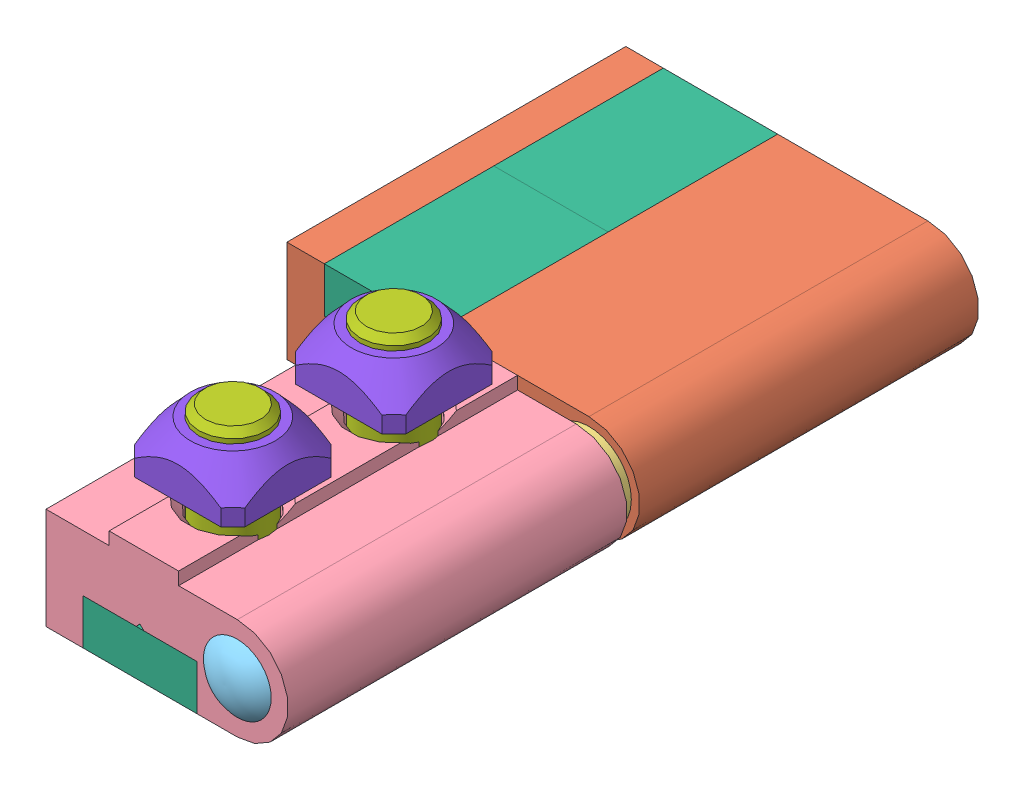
SolidWorks assembly 21.1095 HINGE 32 RIGHT HAND.SLDASM, configuration Default (file format 3800). Lengths in mm.
Overall size (41.65 34.61 84.51).
18 component instances, 8 part files, 39 mates.
Components (placement in the parent):
- 21.1096 HINGE PIN-1: 21.1096 HINGE PIN.SLDPRT [Default] at origin size (6.07 6.07 65)
- 21.1096 HINGE 45 AL BLOCK-2: 21.1096 HINGE 45 AL BLOCK.SLDPRT [Default] at (-24.5 -6 -8.25) x (-1 0 0) z (0 0 -1) size (41.65 13.5 40)
- 21.1096 HINGE WASHER-1: 21.1096 HINGE WASHER.SLDPRT [Default] at (0 0 31.75) size (10 10 1.5)
- 21.1100 HINGE 19 AL BLOCK-1: 21.1100 HINGE 19 AL BLOCK.SLDPRT [Default] at (-11.5 6 73.25) x (-1 0 0) z (0 0 1) size (28.58 13.5 40)
- 21.1096 HINGE PIN END CAP-1: 21.1096 HINGE PIN END CAP.SLDPRT [Default] at (0 0 74.75) x (1 0 0) z (0 -1 0) size (8 7 8)
- 21.1096 HINGE PIN END CAP-2: 21.1096 HINGE PIN END CAP.SLDPRT [Default] at (0 0 -9.75) x (1 0 0) z (0 1 0) size (8 7 8)
- 22.1050 HINGE SCREW CAP-1: 22.1050 HINGE SCREW CAP.SLDPRT [Default] at (-18.2316 -6 63.25) x (0 0 1) z (1 0 0) size (20 5.34 13.5)
- 22.1050 HINGE SCREW CAP-2: 22.1050 HINGE SCREW CAP.SLDPRT [Default] at (-18.2316 -6 43.25) x (0 0 1) z (1 0 0) size (20 5.34 13.5)
- 22.1050 HINGE SCREW CAP-3: 22.1050 HINGE SCREW CAP.SLDPRT [Default] at (-17.7316 6 21.75) x (0 0 1) z (-1 0 0) size (20 5.34 13.5)
- 22.1050 HINGE SCREW CAP-4: 22.1050 HINGE SCREW CAP.SLDPRT [Default] at (-17.7316 6 1.75) x (0 0 1) z (-1 0 0) size (20 5.34 13.5)
- 21.1268 M8X18-1: 21.1268 M8X18.SLDPRT [Default] at (-11.0292 -0.6971 43.75) x (0 1 0) z (0 0 1) size (23 13 13)
- 21.1268 M8X18-2: 21.1268 M8X18.SLDPRT [Default] at (-11.0292 -0.6971 62.75) x (0 1 0) z (0 0 1) size (23 13 13)
- 21.1268 M8X18-3: 21.1268 M8X18.SLDPRT [Default] at (-24.0292 0.6971 21.25) x (0 -1 0) z (0 0 1) size (23 13 13)
- 21.1268 M8X18-4: 21.1268 M8X18.SLDPRT [Default] at (-24.0292 0.6971 2.25) x (0 -1 0) z (0 0 1) size (23 13 13)
- 21.1351 M8 SQUARE NUT-1: 21.1351 M8 SQUARE NUT.SLDPRT [Default] at (-24.0292 -10.5 2.25) x (1 0 0) z (0 1 0) size (13 13 5.5)
- 21.1351 M8 SQUARE NUT-2: 21.1351 M8 SQUARE NUT.SLDPRT [Default] at (-11.0292 10.5 62.75) x (1 0 0) z (0 -1 0) size (13 13 5.5)
- 21.1351 M8 SQUARE NUT-3: 21.1351 M8 SQUARE NUT.SLDPRT [Default] at (-24.0292 -10.5 21.25) x (1 0 0) z (0 1 0) size (13 13 5.5)
- 21.1351 M8 SQUARE NUT-4: 21.1351 M8 SQUARE NUT.SLDPRT [Default] at (-11.0292 10.5 43.75) x (1 0 0) z (0 -1 0) size (13 13 5.5)
Mates (geometry in assembly coordinates):
- Coincident1: coincident aligned: axis of 21.1096 HINGE 45 AL BLOCK-2; axis of 21.1096 HINGE PIN-1
- Distance1: distance = 33.25 mm aligned: plane of 21.1096 HINGE PIN-1 through (0 0 65) normal (0 0 1); plane of 21.1096 HINGE 45 AL BLOCK-2 through (-17.0063 -0.593 31.75) normal (0 0 1)
- Coincident3: coincident aligned: axis of 21.1096 HINGE PIN-1; axis of 21.1096 HINGE WASHER-1
- Coincident4: coincident anti-aligned: plane of 21.1096 HINGE 45 AL BLOCK-2 through (-17.0063 -0.593 31.75) normal (0 0 1); plane of 21.1096 HINGE WASHER-1 through (0 0 31.75) normal (0 0 -1)
- Coincident5: coincident anti-aligned: axis of 21.1096 HINGE PIN-1; axis of 21.1100 HINGE 19 AL BLOCK-1
- Coincident6: coincident anti-aligned: plane of 21.1096 HINGE WASHER-1 through (0 0 33.25) normal (0 0 1); plane of 21.1100 HINGE 19 AL BLOCK-1 through (-9.7205 0.7653 33.25) normal (0 0 -1)
- Coincident7: coincident anti-aligned: plane of 21.1100 HINGE 19 AL BLOCK-1 through (-9.7205 0.7653 73.25) normal (0 0 1); plane of 21.1096 HINGE PIN END CAP-1 through (3.55 0 73.25) normal (0 0 -1)
- Coincident8: coincident anti-aligned: axis of 21.1100 HINGE 19 AL BLOCK-1; axis of 21.1096 HINGE PIN END CAP-1
- Coincident9: coincident anti-aligned: plane of 21.1096 HINGE 45 AL BLOCK-2 through (-17.0063 -0.593 -8.25) normal (0 0 -1); plane of 21.1096 HINGE PIN END CAP-2 through (3.55 0 -8.25) normal (0 0 1)
- Coincident10: coincident aligned: axis of 21.1096 HINGE PIN-1; axis of 21.1096 HINGE PIN END CAP-2
- Coincident11: coincident aligned: plane of 22.1050 HINGE SCREW CAP-1 through (-18.2316 -6 73.25) normal (0 0 1); plane of 21.1100 HINGE 19 AL BLOCK-1 through (-9.7205 0.7653 73.25) normal (0 0 1)
- Coincident12: coincident aligned: plane of 21.1100 HINGE 19 AL BLOCK-1 through (-22.575 -6 73.25) normal (0 -1 0); plane of 22.1050 HINGE SCREW CAP-1 through (-18.2316 -6 53.25) normal (0 -1 0)
- Coincident13: coincident anti-aligned: plane of 21.1100 HINGE 19 AL BLOCK-1 through (-4.7316 -0.6603 73.25) normal (-1 0 0); plane of 22.1050 HINGE SCREW CAP-1 through (-4.7316 -4.4369 63.25) normal (1 0 0)
- Coincident14: coincident anti-aligned: plane of 22.1050 HINGE SCREW CAP-1 through (-18.2316 -0.66 53.25) normal (0 0 -1); plane of 22.1050 HINGE SCREW CAP-2 through (-18.2316 -6 53.25) normal (0 0 1)
- Coincident15: coincident aligned: plane of 22.1050 HINGE SCREW CAP-1 through (-18.2316 -6 53.25) normal (0 -1 0); plane of 22.1050 HINGE SCREW CAP-2 through (-18.2316 -6 33.25) normal (0 -1 0)
- Coincident16: coincident anti-aligned: plane of 21.1100 HINGE 19 AL BLOCK-1 through (-4.7316 -0.6603 73.25) normal (-1 0 0); plane of 22.1050 HINGE SCREW CAP-2 through (-4.7316 -4.4369 43.25) normal (1 0 0)
- Coincident17: coincident aligned: plane of 22.1050 HINGE SCREW CAP-4 through (-17.7316 0.66 -8.25) normal (0 0 -1); plane of 21.1096 HINGE 45 AL BLOCK-2 through (-17.0063 -0.593 -8.25) normal (0 0 -1)
- Coincident18: coincident aligned: plane of 21.1096 HINGE 45 AL BLOCK-2 through (-17.7316 6 -8.25) normal (0 1 0); plane of 22.1050 HINGE SCREW CAP-4 through (-17.7316 6 -8.25) normal (0 1 0)
- Coincident19: coincident anti-aligned: plane of 21.1096 HINGE 45 AL BLOCK-2 through (-17.7316 0.6603 -8.25) normal (-1 0 0); plane of 22.1050 HINGE SCREW CAP-4 through (-17.7316 4.4369 1.75) normal (1 0 0)
- Coincident20: coincident aligned: plane of 22.1050 HINGE SCREW CAP-3 through (-17.7316 6 11.75) normal (0 1 0); plane of 22.1050 HINGE SCREW CAP-4 through (-17.7316 6 -8.25) normal (0 1 0)
- Coincident21: coincident anti-aligned: plane of 22.1050 HINGE SCREW CAP-3 through (-17.7316 0.66 11.75) normal (0 0 -1); plane of 22.1050 HINGE SCREW CAP-4 through (-17.7316 6 11.75) normal (0 0 1)
- Coincident22: coincident anti-aligned: plane of 21.1096 HINGE 45 AL BLOCK-2 through (-17.7316 0.6603 -8.25) normal (-1 0 0); plane of 22.1050 HINGE SCREW CAP-3 through (-17.7316 4.4369 21.75) normal (1 0 0)
- Coincident23: coincident anti-aligned: plane of 21.1100 HINGE 19 AL BLOCK-1 through (-18.2316 -0.6971 73.25) normal (0 -1 0); plane of 21.1268 M8X18-2 through (-16.2792 -0.6971 62.75) normal (0 1 0)
- Coincident24: coincident anti-aligned: axis of 21.1100 HINGE 19 AL BLOCK-1; axis of 21.1268 M8X18-2
- Coincident25: coincident anti-aligned: axis of 21.1100 HINGE 19 AL BLOCK-1; axis of 21.1268 M8X18-1
- Coincident26: coincident anti-aligned: plane of 21.1100 HINGE 19 AL BLOCK-1 through (-18.2316 -0.6971 73.25) normal (0 -1 0); plane of 21.1268 M8X18-1 through (-16.2792 -0.6971 43.75) normal (0 1 0)
- Coincident27: coincident anti-aligned: axis of 21.1096 HINGE 45 AL BLOCK-2; axis of 21.1268 M8X18-4
- Coincident28: coincident anti-aligned: plane of 21.1096 HINGE 45 AL BLOCK-2 through (-31.2316 0.6971 -8.25) normal (0 1 0); plane of 21.1268 M8X18-4 through (-18.7792 0.6971 2.25) normal (0 -1 0)
- Coincident29: coincident anti-aligned: axis of 21.1096 HINGE 45 AL BLOCK-2; axis of 21.1268 M8X18-3
- Coincident30: coincident anti-aligned: plane of 21.1096 HINGE 45 AL BLOCK-2 through (-31.2316 0.6971 -8.25) normal (0 1 0); plane of 21.1268 M8X18-3 through (-18.7792 0.6971 21.25) normal (0 -1 0)
- Coincident31: coincident aligned: axis of 21.1351 M8 SQUARE NUT-2; axis of 21.1268 M8X18-2
- Coincident32: coincident anti-aligned: axis of 21.1268 M8X18-1; axis of 21.1351 M8 SQUARE NUT-4
- Coincident33: coincident aligned: axis of 21.1268 M8X18-3; axis of ?
- Coincident34: coincident aligned: axis of 21.1268 M8X18-4; axis of 21.1351 M8 SQUARE NUT-1
- Distance2: distance = 4.5 mm anti-aligned: plane of 21.1351 M8 SQUARE NUT-1 through (-24.0292 -10.5 2.25) normal (0 1 0); plane of 21.1096 HINGE 45 AL BLOCK-2 through (0 -6 -8.25) normal (0 -1 0)
- Distance3: distance = 4.5 mm anti-aligned: plane of 21.1096 HINGE 45 AL BLOCK-2 through (0 -6 -8.25) normal (0 -1 0); plane of 21.1351 M8 SQUARE NUT-3 through (-24.0292 -10.5 21.25) normal (0 1 0)
- Distance4: distance = 4.5 mm anti-aligned: plane of 21.1351 M8 SQUARE NUT-2 through (-11.0292 10.5 62.75) normal (0 -1 0); plane of 21.1100 HINGE 19 AL BLOCK-1 through (-15.1292 6 73.25) normal (0 1 0)
- Distance5: distance = 4.5 mm anti-aligned: plane of 21.1351 M8 SQUARE NUT-4 through (-11.0292 10.5 43.75) normal (0 -1 0); plane of 21.1100 HINGE 19 AL BLOCK-1 through (0 6 73.25) normal (0 1 0)
- Angle1: planar angle aligned: plane of 21.1351 M8 SQUARE NUT-3 through (-30.5292 -10.5 16.1642) normal (-1 0 0); plane of 21.1096 HINGE 45 AL BLOCK-2 through (-35.65 -6 -8.25) normal (-1 0 0)
